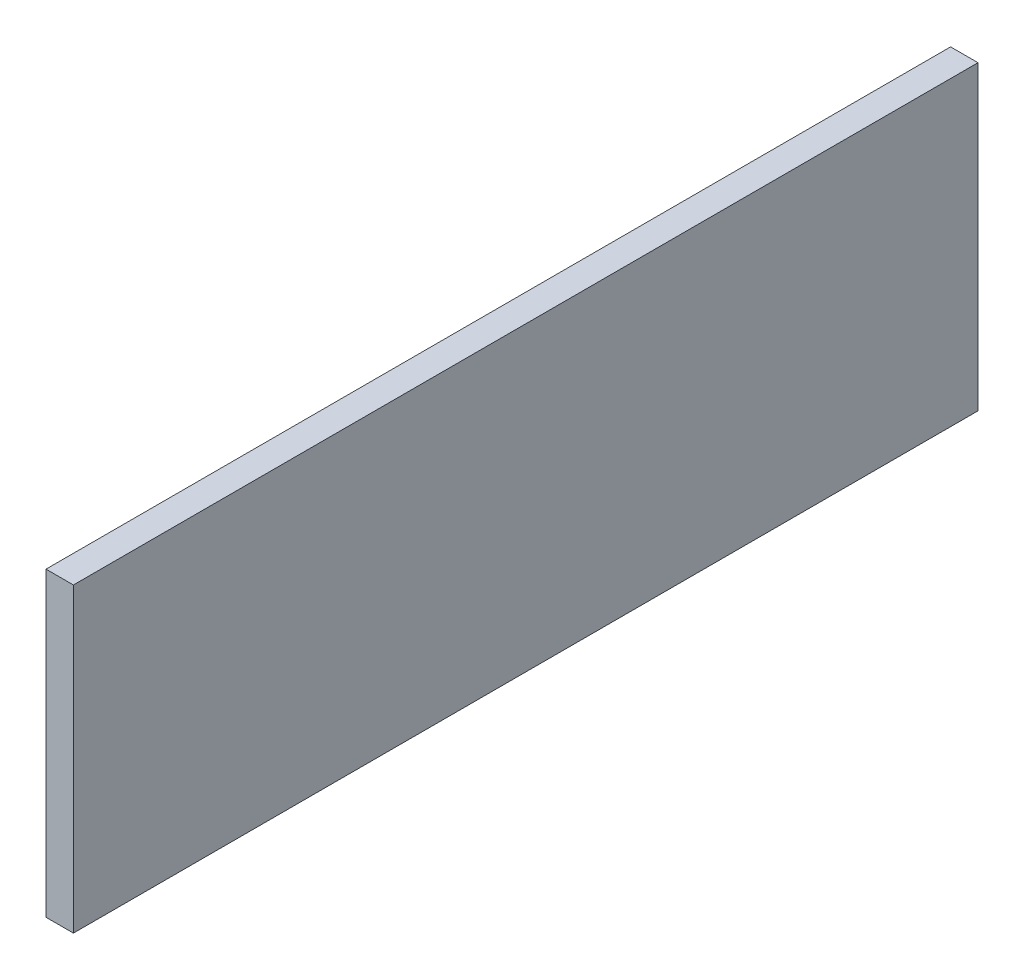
from build123d import *

# Parameters (mm, degrees)
SKETCH1_W      = 419.1
SKETCH1_H      = 139.7
EXTRUDE1_DEPTH = 12.7


with BuildPart() as part:
    # Sketch1 → Extrude1 (new body)
    with BuildSketch(Plane(origin=(0, 0, 0), x_dir=(0, 0, -1), z_dir=(1, 0, 0))):
        Rectangle(SKETCH1_W, SKETCH1_H)
    extrude(amount=EXTRUDE1_DEPTH)


solid = part.part
